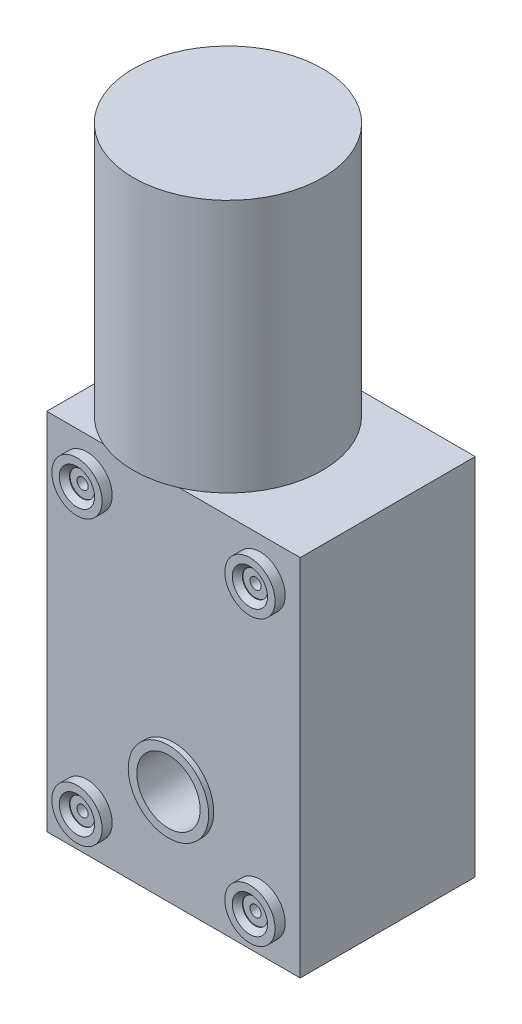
ISO-10303-21;
HEADER;
FILE_DESCRIPTION(('STEP AP214'),'2;1');
FILE_NAME('part.step','',(''),(''),'','','');
FILE_SCHEMA(('AUTOMOTIVE_DESIGN { 1 0 10303 214 1 1 1 1 }'));
ENDSEC;
DATA;
#1=APPLICATION_CONTEXT('core data for automotive mechanical design processes');
#2=APPLICATION_PROTOCOL_DEFINITION('international standard','automotive_design',2000,#1);
#3=PRODUCT_CONTEXT('',#1,'mechanical');
#4=PRODUCT('Part','Part','',(#3));
#5=PRODUCT_RELATED_PRODUCT_CATEGORY('part','',(#4));
#6=PRODUCT_DEFINITION_FORMATION('','',#4);
#7=PRODUCT_DEFINITION_CONTEXT('part definition',#1,'design');
#8=PRODUCT_DEFINITION('design','',#6,#7);
#9=PRODUCT_DEFINITION_SHAPE('','',#8);
#10=(LENGTH_UNIT() NAMED_UNIT(*) SI_UNIT(.MILLI.,.METRE.));
#11=(NAMED_UNIT(*) PLANE_ANGLE_UNIT() SI_UNIT($,.RADIAN.));
#12=(NAMED_UNIT(*) SI_UNIT($,.STERADIAN.) SOLID_ANGLE_UNIT());
#13=UNCERTAINTY_MEASURE_WITH_UNIT(LENGTH_MEASURE(1.E-05),#10,'distance_accuracy_value','');
#14=(GEOMETRIC_REPRESENTATION_CONTEXT(3) GLOBAL_UNCERTAINTY_ASSIGNED_CONTEXT((#13)) GLOBAL_UNIT_ASSIGNED_CONTEXT((#10,
#11,#12)) REPRESENTATION_CONTEXT('',''));
#15=CARTESIAN_POINT('',(0.,0.,0.));
#16=DIRECTION('',(0.,0.,1.));
#17=DIRECTION('',(1.,0.,0.));
#18=AXIS2_PLACEMENT_3D('',#15,#16,#17);
#19=CARTESIAN_POINT('',(0.,45.974,0.));
#20=DIRECTION('',(0.,-1.,0.));
#21=DIRECTION('',(0.,0.,-1.));
#22=AXIS2_PLACEMENT_3D('',#19,#20,#21);
#23=PLANE('',#22);
#24=CARTESIAN_POINT('',(11.938,45.974,-10.9404351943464));
#25=DIRECTION('',(0.,1.,0.));
#26=DIRECTION('',(0.,0.,1.));
#27=AXIS2_PLACEMENT_3D('',#24,#25,#26);
#28=CIRCLE('',#27,11.938);
#29=CARTESIAN_POINT('',(16.7153132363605,45.974,0.));
#30=VERTEX_POINT('',#29);
#31=CARTESIAN_POINT('',(16.1835378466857,45.974,-22.098));
#32=VERTEX_POINT('',#31);
#33=EDGE_CURVE('E219',#30,#32,#28,.T.);
#34=ORIENTED_EDGE('',*,*,#33,.F.);
#35=DIRECTION('',(1.,0.,0.));
#36=VECTOR('',#35,1.);
#37=CARTESIAN_POINT('',(0.,45.974,0.));
#38=LINE('',#37,#36);
#39=CARTESIAN_POINT('',(32.004,45.974,0.));
#40=VERTEX_POINT('',#39);
#41=EDGE_CURVE('E228',#30,#40,#38,.T.);
#42=ORIENTED_EDGE('',*,*,#41,.T.);
#43=DIRECTION('',(0.,0.,-1.));
#44=VECTOR('',#43,1.);
#45=CARTESIAN_POINT('',(32.004,45.974,0.));
#46=LINE('',#45,#44);
#47=CARTESIAN_POINT('',(32.004,45.974,-22.098));
#48=VERTEX_POINT('',#47);
#49=EDGE_CURVE('E233',#40,#48,#46,.T.);
#50=ORIENTED_EDGE('',*,*,#49,.T.);
#51=DIRECTION('',(-1.,0.,0.));
#52=VECTOR('',#51,1.);
#53=CARTESIAN_POINT('',(0.,45.974,-22.098));
#54=LINE('',#53,#52);
#55=EDGE_CURVE('E238',#48,#32,#54,.T.);
#56=ORIENTED_EDGE('',*,*,#55,.T.);
#57=EDGE_LOOP('',(#34,#42,#50,#56));
#58=FACE_BOUND('',#57,.T.);
#59=ADVANCED_FACE('F45',(#58),#23,.F.);
#60=CARTESIAN_POINT('',(7.69246215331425,45.974,-22.098));
#61=VERTEX_POINT('',#60);
#62=CARTESIAN_POINT('',(0.,45.974,-10.9404351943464));
#63=VERTEX_POINT('',#62);
#64=EDGE_CURVE('E61',#61,#63,#28,.T.);
#65=ORIENTED_EDGE('',*,*,#64,.F.);
#66=CARTESIAN_POINT('',(0.,45.974,-22.098));
#67=VERTEX_POINT('',#66);
#68=EDGE_CURVE('E237',#61,#67,#54,.T.);
#69=ORIENTED_EDGE('',*,*,#68,.T.);
#70=DIRECTION('',(0.,0.,1.));
#71=VECTOR('',#70,1.);
#72=CARTESIAN_POINT('',(0.,45.974,0.));
#73=LINE('',#72,#71);
#74=EDGE_CURVE('E225',#67,#63,#73,.T.);
#75=ORIENTED_EDGE('',*,*,#74,.T.);
#76=EDGE_LOOP('',(#65,#69,#75));
#77=FACE_BOUND('',#76,.T.);
#78=ADVANCED_FACE('F314',(#77),#23,.F.);
#79=CARTESIAN_POINT('',(0.,45.974,0.));
#80=DIRECTION('',(1.,0.,0.));
#81=DIRECTION('',(0.,0.,-1.));
#82=AXIS2_PLACEMENT_3D('',#79,#80,#81);
#83=PLANE('',#82);
#84=DIRECTION('',(0.,0.,1.));
#85=VECTOR('',#84,1.);
#86=CARTESIAN_POINT('',(0.,0.,0.));
#87=LINE('',#86,#85);
#88=CARTESIAN_POINT('',(0.,0.,-22.098));
#89=VERTEX_POINT('',#88);
#90=CARTESIAN_POINT('',(0.,0.,0.));
#91=VERTEX_POINT('',#90);
#92=EDGE_CURVE('E218',#89,#91,#87,.T.);
#93=ORIENTED_EDGE('',*,*,#92,.T.);
#94=DIRECTION('',(0.,-1.,0.));
#95=VECTOR('',#94,1.);
#96=CARTESIAN_POINT('',(0.,45.974,0.));
#97=LINE('',#96,#95);
#98=CARTESIAN_POINT('',(0.,45.974,0.));
#99=VERTEX_POINT('',#98);
#100=EDGE_CURVE('E265',#99,#91,#97,.T.);
#101=ORIENTED_EDGE('',*,*,#100,.F.);
#102=EDGE_CURVE('E229',#63,#99,#73,.T.);
#103=ORIENTED_EDGE('',*,*,#102,.F.);
#104=ORIENTED_EDGE('',*,*,#74,.F.);
#105=DIRECTION('',(0.,-1.,0.));
#106=VECTOR('',#105,1.);
#107=CARTESIAN_POINT('',(0.,45.974,-22.098));
#108=LINE('',#107,#106);
#109=EDGE_CURVE('E241',#67,#89,#108,.T.);
#110=ORIENTED_EDGE('',*,*,#109,.T.);
#111=EDGE_LOOP('',(#93,#101,#103,#104,#110));
#112=FACE_BOUND('',#111,.T.);
#113=ADVANCED_FACE('F47',(#112),#83,.F.);
#114=CARTESIAN_POINT('',(0.,45.974,0.));
#115=DIRECTION('',(0.,0.,-1.));
#116=DIRECTION('',(-1.,0.,0.));
#117=AXIS2_PLACEMENT_3D('',#114,#115,#116);
#118=PLANE('',#117);
#119=CARTESIAN_POINT('',(16.002,12.7,0.));
#120=DIRECTION('',(0.,0.,-1.));
#121=DIRECTION('',(-1.,0.,0.));
#122=AXIS2_PLACEMENT_3D('',#119,#120,#121);
#123=CIRCLE('',#122,5.08);
#124=CARTESIAN_POINT('',(10.922,12.7,0.));
#125=VERTEX_POINT('',#124);
#126=EDGE_CURVE('E11',#125,#125,#123,.F.);
#127=ORIENTED_EDGE('',*,*,#126,.F.);
#128=EDGE_LOOP('',(#127));
#129=FACE_BOUND('',#128,.T.);
#130=CARTESIAN_POINT('',(5.08,5.08,0.));
#131=DIRECTION('',(0.,0.,-1.));
#132=DIRECTION('',(-1.,0.,0.));
#133=AXIS2_PLACEMENT_3D('',#130,#131,#132);
#134=CIRCLE('',#133,3.175);
#135=CARTESIAN_POINT('',(1.905,5.08,0.));
#136=VERTEX_POINT('',#135);
#137=EDGE_CURVE('E54',#136,#136,#134,.F.);
#138=ORIENTED_EDGE('',*,*,#137,.F.);
#139=EDGE_LOOP('',(#138));
#140=FACE_BOUND('',#139,.T.);
#141=CARTESIAN_POINT('',(26.924,5.08,0.));
#142=DIRECTION('',(0.,0.,-1.));
#143=DIRECTION('',(-1.,0.,0.));
#144=AXIS2_PLACEMENT_3D('',#141,#142,#143);
#145=CIRCLE('',#144,3.175);
#146=CARTESIAN_POINT('',(23.749,5.08,0.));
#147=VERTEX_POINT('',#146);
#148=EDGE_CURVE('E277',#147,#147,#145,.F.);
#149=ORIENTED_EDGE('',*,*,#148,.F.);
#150=EDGE_LOOP('',(#149));
#151=FACE_BOUND('',#150,.T.);
#152=CARTESIAN_POINT('',(26.924,40.894,0.));
#153=DIRECTION('',(0.,0.,-1.));
#154=DIRECTION('',(-1.,0.,0.));
#155=AXIS2_PLACEMENT_3D('',#152,#153,#154);
#156=CIRCLE('',#155,3.175);
#157=CARTESIAN_POINT('',(23.749,40.894,0.));
#158=VERTEX_POINT('',#157);
#159=EDGE_CURVE('E273',#158,#158,#156,.F.);
#160=ORIENTED_EDGE('',*,*,#159,.F.);
#161=EDGE_LOOP('',(#160));
#162=FACE_BOUND('',#161,.T.);
#163=CARTESIAN_POINT('',(5.08,40.894,0.));
#164=DIRECTION('',(0.,0.,-1.));
#165=DIRECTION('',(-1.,0.,0.));
#166=AXIS2_PLACEMENT_3D('',#163,#164,#165);
#167=CIRCLE('',#166,3.175);
#168=CARTESIAN_POINT('',(1.905,40.894,0.));
#169=VERTEX_POINT('',#168);
#170=EDGE_CURVE('E269',#169,#169,#167,.F.);
#171=ORIENTED_EDGE('',*,*,#170,.F.);
#172=EDGE_LOOP('',(#171));
#173=FACE_BOUND('',#172,.T.);
#174=DIRECTION('',(1.,0.,0.));
#175=VECTOR('',#174,1.);
#176=CARTESIAN_POINT('',(0.,0.,0.));
#177=LINE('',#176,#175);
#178=CARTESIAN_POINT('',(32.004,0.,0.));
#179=VERTEX_POINT('',#178);
#180=EDGE_CURVE('E245',#91,#179,#177,.T.);
#181=ORIENTED_EDGE('',*,*,#180,.T.);
#182=DIRECTION('',(0.,-1.,0.));
#183=VECTOR('',#182,1.);
#184=CARTESIAN_POINT('',(32.004,45.974,0.));
#185=LINE('',#184,#183);
#186=EDGE_CURVE('E261',#40,#179,#185,.T.);
#187=ORIENTED_EDGE('',*,*,#186,.F.);
#188=ORIENTED_EDGE('',*,*,#41,.F.);
#189=CARTESIAN_POINT('',(7.16068676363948,45.974,0.));
#190=VERTEX_POINT('',#189);
#191=EDGE_CURVE('E234',#190,#30,#38,.T.);
#192=ORIENTED_EDGE('',*,*,#191,.F.);
#193=EDGE_CURVE('E230',#99,#190,#38,.T.);
#194=ORIENTED_EDGE('',*,*,#193,.F.);
#195=ORIENTED_EDGE('',*,*,#100,.T.);
#196=EDGE_LOOP('',(#181,#187,#188,#192,#194,#195));
#197=FACE_BOUND('',#196,.T.);
#198=ADVANCED_FACE('F286',(#129,#140,#151,#162,#173,#197),#118,.F.);
#199=CARTESIAN_POINT('',(32.004,45.974,0.));
#200=DIRECTION('',(-1.,0.,0.));
#201=DIRECTION('',(0.,0.,1.));
#202=AXIS2_PLACEMENT_3D('',#199,#200,#201);
#203=PLANE('',#202);
#204=DIRECTION('',(0.,0.,-1.));
#205=VECTOR('',#204,1.);
#206=CARTESIAN_POINT('',(32.004,0.,0.));
#207=LINE('',#206,#205);
#208=CARTESIAN_POINT('',(32.004,0.,-22.098));
#209=VERTEX_POINT('',#208);
#210=EDGE_CURVE('E248',#179,#209,#207,.T.);
#211=ORIENTED_EDGE('',*,*,#210,.T.);
#212=DIRECTION('',(0.,-1.,0.));
#213=VECTOR('',#212,1.);
#214=CARTESIAN_POINT('',(32.004,45.974,-22.098));
#215=LINE('',#214,#213);
#216=EDGE_CURVE('E257',#48,#209,#215,.T.);
#217=ORIENTED_EDGE('',*,*,#216,.F.);
#218=ORIENTED_EDGE('',*,*,#49,.F.);
#219=ORIENTED_EDGE('',*,*,#186,.T.);
#220=EDGE_LOOP('',(#211,#217,#218,#219));
#221=FACE_BOUND('',#220,.T.);
#222=ADVANCED_FACE('F289',(#221),#203,.F.);
#223=CARTESIAN_POINT('',(0.,45.974,-22.098));
#224=DIRECTION('',(0.,0.,1.));
#225=DIRECTION('',(1.,0.,0.));
#226=AXIS2_PLACEMENT_3D('',#223,#224,#225);
#227=PLANE('',#226);
#228=DIRECTION('',(-1.,0.,0.));
#229=VECTOR('',#228,1.);
#230=CARTESIAN_POINT('',(0.,0.,-22.098));
#231=LINE('',#230,#229);
#232=EDGE_CURVE('E251',#209,#89,#231,.T.);
#233=ORIENTED_EDGE('',*,*,#232,.T.);
#234=ORIENTED_EDGE('',*,*,#109,.F.);
#235=ORIENTED_EDGE('',*,*,#68,.F.);
#236=EDGE_CURVE('E68',#32,#61,#54,.T.);
#237=ORIENTED_EDGE('',*,*,#236,.F.);
#238=ORIENTED_EDGE('',*,*,#55,.F.);
#239=ORIENTED_EDGE('',*,*,#216,.T.);
#240=EDGE_LOOP('',(#233,#234,#235,#237,#238,#239));
#241=FACE_BOUND('',#240,.T.);
#242=ADVANCED_FACE('F310',(#241),#227,.F.);
#243=EDGE_CURVE('E224',#63,#190,#28,.T.);
#244=ORIENTED_EDGE('',*,*,#243,.F.);
#245=ORIENTED_EDGE('',*,*,#102,.T.);
#246=ORIENTED_EDGE('',*,*,#193,.T.);
#247=EDGE_LOOP('',(#244,#245,#246));
#248=FACE_BOUND('',#247,.T.);
#249=ADVANCED_FACE('F349',(#248),#23,.F.);
#250=CARTESIAN_POINT('',(0.,0.,0.));
#251=DIRECTION('',(0.,-1.,0.));
#252=DIRECTION('',(0.,0.,-1.));
#253=AXIS2_PLACEMENT_3D('',#250,#251,#252);
#254=PLANE('',#253);
#255=ORIENTED_EDGE('',*,*,#92,.F.);
#256=ORIENTED_EDGE('',*,*,#232,.F.);
#257=ORIENTED_EDGE('',*,*,#210,.F.);
#258=ORIENTED_EDGE('',*,*,#180,.F.);
#259=EDGE_LOOP('',(#255,#256,#257,#258));
#260=FACE_BOUND('',#259,.T.);
#261=ADVANCED_FACE('F308',(#260),#254,.T.);
#262=CARTESIAN_POINT('',(11.938,45.974,-10.9404351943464));
#263=DIRECTION('',(0.,1.,0.));
#264=DIRECTION('',(0.,0.,1.));
#265=AXIS2_PLACEMENT_3D('',#262,#263,#264);
#266=PLANE('',#265);
#267=EDGE_CURVE('E213',#190,#30,#28,.T.);
#268=ORIENTED_EDGE('',*,*,#267,.F.);
#269=ORIENTED_EDGE('',*,*,#191,.T.);
#270=EDGE_LOOP('',(#268,#269));
#271=FACE_BOUND('',#270,.T.);
#272=ADVANCED_FACE('F328',(#271),#266,.F.);
#273=EDGE_CURVE('E223',#32,#61,#28,.T.);
#274=ORIENTED_EDGE('',*,*,#273,.F.);
#275=ORIENTED_EDGE('',*,*,#236,.T.);
#276=EDGE_LOOP('',(#274,#275));
#277=FACE_BOUND('',#276,.T.);
#278=ADVANCED_FACE('F334',(#277),#266,.F.);
#279=CARTESIAN_POINT('',(11.938,77.978,-10.9404351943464));
#280=DIRECTION('',(0.,-1.,0.));
#281=DIRECTION('',(0.,0.,-1.));
#282=AXIS2_PLACEMENT_3D('',#279,#280,#281);
#283=CYLINDRICAL_SURFACE('',#282,11.938);
#284=CARTESIAN_POINT('',(11.938,77.978,-10.9404351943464));
#285=DIRECTION('',(0.,1.,0.));
#286=DIRECTION('',(0.,0.,1.));
#287=AXIS2_PLACEMENT_3D('',#284,#285,#286);
#288=CIRCLE('',#287,11.938);
#289=CARTESIAN_POINT('',(11.938,77.978,0.997564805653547));
#290=VERTEX_POINT('',#289);
#291=EDGE_CURVE('E214',#290,#290,#288,.T.);
#292=ORIENTED_EDGE('',*,*,#291,.F.);
#293=EDGE_LOOP('',(#292));
#294=FACE_BOUND('',#293,.T.);
#295=ORIENTED_EDGE('',*,*,#33,.T.);
#296=ORIENTED_EDGE('',*,*,#273,.T.);
#297=ORIENTED_EDGE('',*,*,#64,.T.);
#298=ORIENTED_EDGE('',*,*,#243,.T.);
#299=ORIENTED_EDGE('',*,*,#267,.T.);
#300=EDGE_LOOP('',(#295,#296,#297,#298,#299));
#301=FACE_BOUND('',#300,.T.);
#302=ADVANCED_FACE('F318',(#294,#301),#283,.T.);
#303=CARTESIAN_POINT('',(11.938,77.978,-10.9404351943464));
#304=DIRECTION('',(0.,1.,0.));
#305=DIRECTION('',(0.,0.,1.));
#306=AXIS2_PLACEMENT_3D('',#303,#304,#305);
#307=PLANE('',#306);
#308=ORIENTED_EDGE('',*,*,#291,.T.);
#309=EDGE_LOOP('',(#308));
#310=FACE_BOUND('',#309,.T.);
#311=ADVANCED_FACE('F343',(#310),#307,.T.);
#312=CARTESIAN_POINT('',(5.08,40.894,1.27));
#313=DIRECTION('',(0.,0.,-1.));
#314=DIRECTION('',(-1.,0.,0.));
#315=AXIS2_PLACEMENT_3D('',#312,#313,#314);
#316=CYLINDRICAL_SURFACE('',#315,3.175);
#317=CARTESIAN_POINT('',(5.08,40.894,1.27));
#318=DIRECTION('',(0.,0.,1.));
#319=DIRECTION('',(1.,0.,0.));
#320=AXIS2_PLACEMENT_3D('',#317,#318,#319);
#321=CIRCLE('',#320,3.175);
#322=CARTESIAN_POINT('',(8.255,40.894,1.27));
#323=VERTEX_POINT('',#322);
#324=EDGE_CURVE('E202',#323,#323,#321,.T.);
#325=ORIENTED_EDGE('',*,*,#324,.F.);
#326=EDGE_LOOP('',(#325));
#327=FACE_BOUND('',#326,.T.);
#328=ORIENTED_EDGE('',*,*,#170,.T.);
#329=EDGE_LOOP('',(#328));
#330=FACE_BOUND('',#329,.T.);
#331=ADVANCED_FACE('F413',(#327,#330),#316,.T.);
#332=CARTESIAN_POINT('',(5.08,40.894,1.27));
#333=DIRECTION('',(0.,0.,1.));
#334=DIRECTION('',(1.,0.,0.));
#335=AXIS2_PLACEMENT_3D('',#332,#333,#334);
#336=PLANE('',#335);
#337=CARTESIAN_POINT('',(5.08,40.894,1.27));
#338=DIRECTION('',(0.,0.,1.));
#339=DIRECTION('',(1.,0.,0.));
#340=AXIS2_PLACEMENT_3D('',#337,#338,#339);
#341=CIRCLE('',#340,2.2225);
#342=CARTESIAN_POINT('',(7.3025,40.894,1.27));
#343=VERTEX_POINT('',#342);
#344=EDGE_CURVE('E731',#343,#343,#341,.T.);
#345=ORIENTED_EDGE('',*,*,#344,.F.);
#346=EDGE_LOOP('',(#345));
#347=FACE_BOUND('',#346,.T.);
#348=ORIENTED_EDGE('',*,*,#324,.T.);
#349=EDGE_LOOP('',(#348));
#350=FACE_BOUND('',#349,.T.);
#351=ADVANCED_FACE('F422',(#347,#350),#336,.T.);
#352=CARTESIAN_POINT('',(26.924,40.894,1.27));
#353=DIRECTION('',(0.,0.,-1.));
#354=DIRECTION('',(-1.,0.,0.));
#355=AXIS2_PLACEMENT_3D('',#352,#353,#354);
#356=CYLINDRICAL_SURFACE('',#355,3.175);
#357=CARTESIAN_POINT('',(26.924,40.894,1.27));
#358=DIRECTION('',(0.,0.,1.));
#359=DIRECTION('',(1.,0.,0.));
#360=AXIS2_PLACEMENT_3D('',#357,#358,#359);
#361=CIRCLE('',#360,3.175);
#362=CARTESIAN_POINT('',(30.099,40.894,1.27));
#363=VERTEX_POINT('',#362);
#364=EDGE_CURVE('E198',#363,#363,#361,.T.);
#365=ORIENTED_EDGE('',*,*,#364,.F.);
#366=EDGE_LOOP('',(#365));
#367=FACE_BOUND('',#366,.T.);
#368=ORIENTED_EDGE('',*,*,#159,.T.);
#369=EDGE_LOOP('',(#368));
#370=FACE_BOUND('',#369,.T.);
#371=ADVANCED_FACE('F433',(#367,#370),#356,.T.);
#372=CARTESIAN_POINT('',(26.924,40.894,1.27));
#373=DIRECTION('',(0.,0.,1.));
#374=DIRECTION('',(1.,0.,0.));
#375=AXIS2_PLACEMENT_3D('',#372,#373,#374);
#376=PLANE('',#375);
#377=CARTESIAN_POINT('',(26.924,40.894,1.27));
#378=DIRECTION('',(0.,0.,1.));
#379=DIRECTION('',(1.,0.,0.));
#380=AXIS2_PLACEMENT_3D('',#377,#378,#379);
#381=CIRCLE('',#380,2.2225);
#382=CARTESIAN_POINT('',(29.1465,40.894,1.27));
#383=VERTEX_POINT('',#382);
#384=EDGE_CURVE('E125',#383,#383,#381,.T.);
#385=ORIENTED_EDGE('',*,*,#384,.F.);
#386=EDGE_LOOP('',(#385));
#387=FACE_BOUND('',#386,.T.);
#388=ORIENTED_EDGE('',*,*,#364,.T.);
#389=EDGE_LOOP('',(#388));
#390=FACE_BOUND('',#389,.T.);
#391=ADVANCED_FACE('F444',(#387,#390),#376,.T.);
#392=CARTESIAN_POINT('',(26.924,5.08,1.27));
#393=DIRECTION('',(0.,0.,-1.));
#394=DIRECTION('',(-1.,0.,0.));
#395=AXIS2_PLACEMENT_3D('',#392,#393,#394);
#396=CYLINDRICAL_SURFACE('',#395,3.175);
#397=CARTESIAN_POINT('',(26.924,5.08,1.27));
#398=DIRECTION('',(0.,0.,1.));
#399=DIRECTION('',(1.,0.,0.));
#400=AXIS2_PLACEMENT_3D('',#397,#398,#399);
#401=CIRCLE('',#400,3.175);
#402=CARTESIAN_POINT('',(30.099,5.08,1.27));
#403=VERTEX_POINT('',#402);
#404=EDGE_CURVE('E203',#403,#403,#401,.T.);
#405=ORIENTED_EDGE('',*,*,#404,.F.);
#406=EDGE_LOOP('',(#405));
#407=FACE_BOUND('',#406,.T.);
#408=ORIENTED_EDGE('',*,*,#148,.T.);
#409=EDGE_LOOP('',(#408));
#410=FACE_BOUND('',#409,.T.);
#411=ADVANCED_FACE('F454',(#407,#410),#396,.T.);
#412=CARTESIAN_POINT('',(26.924,5.08,1.27));
#413=DIRECTION('',(0.,0.,1.));
#414=DIRECTION('',(1.,0.,0.));
#415=AXIS2_PLACEMENT_3D('',#412,#413,#414);
#416=PLANE('',#415);
#417=CARTESIAN_POINT('',(26.924,5.08,1.27));
#418=DIRECTION('',(0.,0.,1.));
#419=DIRECTION('',(1.,0.,0.));
#420=AXIS2_PLACEMENT_3D('',#417,#418,#419);
#421=CIRCLE('',#420,2.2225);
#422=CARTESIAN_POINT('',(29.1465,5.08,1.27));
#423=VERTEX_POINT('',#422);
#424=EDGE_CURVE('E153',#423,#423,#421,.T.);
#425=ORIENTED_EDGE('',*,*,#424,.F.);
#426=EDGE_LOOP('',(#425));
#427=FACE_BOUND('',#426,.T.);
#428=ORIENTED_EDGE('',*,*,#404,.T.);
#429=EDGE_LOOP('',(#428));
#430=FACE_BOUND('',#429,.T.);
#431=ADVANCED_FACE('F464',(#427,#430),#416,.T.);
#432=CARTESIAN_POINT('',(5.08,5.08,1.27));
#433=DIRECTION('',(0.,0.,-1.));
#434=DIRECTION('',(-1.,0.,0.));
#435=AXIS2_PLACEMENT_3D('',#432,#433,#434);
#436=CYLINDRICAL_SURFACE('',#435,3.175);
#437=CARTESIAN_POINT('',(5.08,5.08,1.27));
#438=DIRECTION('',(0.,0.,1.));
#439=DIRECTION('',(1.,0.,0.));
#440=AXIS2_PLACEMENT_3D('',#437,#438,#439);
#441=CIRCLE('',#440,3.175);
#442=CARTESIAN_POINT('',(8.255,5.08,1.27));
#443=VERTEX_POINT('',#442);
#444=EDGE_CURVE('E197',#443,#443,#441,.T.);
#445=ORIENTED_EDGE('',*,*,#444,.F.);
#446=EDGE_LOOP('',(#445));
#447=FACE_BOUND('',#446,.T.);
#448=ORIENTED_EDGE('',*,*,#137,.T.);
#449=EDGE_LOOP('',(#448));
#450=FACE_BOUND('',#449,.T.);
#451=ADVANCED_FACE('F284',(#447,#450),#436,.T.);
#452=CARTESIAN_POINT('',(5.08,5.08,1.27));
#453=DIRECTION('',(0.,0.,1.));
#454=DIRECTION('',(1.,0.,0.));
#455=AXIS2_PLACEMENT_3D('',#452,#453,#454);
#456=PLANE('',#455);
#457=CARTESIAN_POINT('',(5.08,5.08,1.27));
#458=DIRECTION('',(0.,0.,1.));
#459=DIRECTION('',(1.,0.,0.));
#460=AXIS2_PLACEMENT_3D('',#457,#458,#459);
#461=CIRCLE('',#460,2.2225);
#462=CARTESIAN_POINT('',(7.3025,5.08,1.27));
#463=VERTEX_POINT('',#462);
#464=EDGE_CURVE('E173',#463,#463,#461,.T.);
#465=ORIENTED_EDGE('',*,*,#464,.F.);
#466=EDGE_LOOP('',(#465));
#467=FACE_BOUND('',#466,.T.);
#468=ORIENTED_EDGE('',*,*,#444,.T.);
#469=EDGE_LOOP('',(#468));
#470=FACE_BOUND('',#469,.T.);
#471=ADVANCED_FACE('F483',(#467,#470),#456,.T.);
#472=CARTESIAN_POINT('',(16.002,12.7,0.635));
#473=DIRECTION('',(0.,0.,-1.));
#474=DIRECTION('',(-1.,0.,0.));
#475=AXIS2_PLACEMENT_3D('',#472,#473,#474);
#476=CYLINDRICAL_SURFACE('',#475,5.08);
#477=CARTESIAN_POINT('',(16.002,12.7,0.635));
#478=DIRECTION('',(0.,0.,1.));
#479=DIRECTION('',(1.,0.,0.));
#480=AXIS2_PLACEMENT_3D('',#477,#478,#479);
#481=CIRCLE('',#480,5.08);
#482=CARTESIAN_POINT('',(21.082,12.7,0.635));
#483=VERTEX_POINT('',#482);
#484=EDGE_CURVE('E193',#483,#483,#481,.T.);
#485=ORIENTED_EDGE('',*,*,#484,.F.);
#486=EDGE_LOOP('',(#485));
#487=FACE_BOUND('',#486,.T.);
#488=ORIENTED_EDGE('',*,*,#126,.T.);
#489=EDGE_LOOP('',(#488));
#490=FACE_BOUND('',#489,.T.);
#491=ADVANCED_FACE('F492',(#487,#490),#476,.T.);
#492=CARTESIAN_POINT('',(16.002,12.7,0.635));
#493=DIRECTION('',(0.,0.,1.));
#494=DIRECTION('',(1.,0.,0.));
#495=AXIS2_PLACEMENT_3D('',#492,#493,#494);
#496=PLANE('',#495);
#497=CARTESIAN_POINT('',(16.002,12.7,0.635));
#498=DIRECTION('',(0.,0.,1.));
#499=DIRECTION('',(1.,0.,0.));
#500=AXIS2_PLACEMENT_3D('',#497,#498,#499);
#501=CIRCLE('',#500,4.0005);
#502=CARTESIAN_POINT('',(20.0025,12.7,0.635));
#503=VERTEX_POINT('',#502);
#504=EDGE_CURVE('E732',#503,#503,#501,.T.);
#505=ORIENTED_EDGE('',*,*,#504,.F.);
#506=EDGE_LOOP('',(#505));
#507=FACE_BOUND('',#506,.T.);
#508=ORIENTED_EDGE('',*,*,#484,.T.);
#509=EDGE_LOOP('',(#508));
#510=FACE_BOUND('',#509,.T.);
#511=ADVANCED_FACE('F502',(#507,#510),#496,.T.);
#512=CARTESIAN_POINT('',(5.08,5.08,-11.43));
#513=DIRECTION('',(0.,0.,1.));
#514=DIRECTION('',(1.,0.,0.));
#515=AXIS2_PLACEMENT_3D('',#512,#513,#514);
#516=CONICAL_SURFACE('',#515,0.698499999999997,1.02974425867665);
#517=CARTESIAN_POINT('',(5.08,5.08,-11.8497011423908));
#518=VERTEX_POINT('',#517);
#519=VERTEX_LOOP('',#518);
#520=FACE_BOUND('',#519,.T.);
#521=CARTESIAN_POINT('',(5.08,5.08,-11.43));
#522=DIRECTION('',(0.,0.,1.));
#523=DIRECTION('',(1.,0.,0.));
#524=AXIS2_PLACEMENT_3D('',#521,#522,#523);
#525=CIRCLE('',#524,0.698499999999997);
#526=CARTESIAN_POINT('',(5.7785,5.08,-11.43));
#527=VERTEX_POINT('',#526);
#528=EDGE_CURVE('E189',#527,#527,#525,.T.);
#529=ORIENTED_EDGE('',*,*,#528,.T.);
#530=EDGE_LOOP('',(#529));
#531=FACE_BOUND('',#530,.T.);
#532=ADVANCED_FACE('F512',(#520,#531),#516,.F.);
#533=CARTESIAN_POINT('',(5.08,5.08,1.27));
#534=DIRECTION('',(0.,0.,1.));
#535=DIRECTION('',(1.,0.,0.));
#536=AXIS2_PLACEMENT_3D('',#533,#534,#535);
#537=CYLINDRICAL_SURFACE('',#536,0.698499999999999);
#538=ORIENTED_EDGE('',*,*,#528,.F.);
#539=EDGE_LOOP('',(#538));
#540=FACE_BOUND('',#539,.T.);
#541=CARTESIAN_POINT('',(5.08,5.08,0.5588));
#542=DIRECTION('',(0.,0.,1.));
#543=DIRECTION('',(1.,0.,0.));
#544=AXIS2_PLACEMENT_3D('',#541,#542,#543);
#545=CIRCLE('',#544,0.698500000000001);
#546=CARTESIAN_POINT('',(5.7785,5.08,0.5588));
#547=VERTEX_POINT('',#546);
#548=EDGE_CURVE('E185',#547,#547,#545,.T.);
#549=ORIENTED_EDGE('',*,*,#548,.T.);
#550=EDGE_LOOP('',(#549));
#551=FACE_BOUND('',#550,.T.);
#552=ADVANCED_FACE('F523',(#540,#551),#537,.F.);
#553=CARTESIAN_POINT('',(5.7785,5.08,0.5588));
#554=DIRECTION('',(0.,0.,-1.));
#555=DIRECTION('',(-1.,0.,0.));
#556=AXIS2_PLACEMENT_3D('',#553,#554,#555);
#557=PLANE('',#556);
#558=ORIENTED_EDGE('',*,*,#548,.F.);
#559=EDGE_LOOP('',(#558));
#560=FACE_BOUND('',#559,.T.);
#561=CARTESIAN_POINT('',(5.08,5.08,0.5588));
#562=DIRECTION('',(0.,0.,1.));
#563=DIRECTION('',(1.,0.,0.));
#564=AXIS2_PLACEMENT_3D('',#561,#562,#563);
#565=CIRCLE('',#564,1.5875);
#566=CARTESIAN_POINT('',(6.6675,5.08,0.5588));
#567=VERTEX_POINT('',#566);
#568=EDGE_CURVE('E181',#567,#567,#565,.T.);
#569=ORIENTED_EDGE('',*,*,#568,.T.);
#570=EDGE_LOOP('',(#569));
#571=FACE_BOUND('',#570,.T.);
#572=ADVANCED_FACE('F533',(#560,#571),#557,.F.);
#573=CARTESIAN_POINT('',(5.08,5.08,1.27));
#574=DIRECTION('',(0.,0.,1.));
#575=DIRECTION('',(1.,0.,0.));
#576=AXIS2_PLACEMENT_3D('',#573,#574,#575);
#577=CYLINDRICAL_SURFACE('',#576,1.5875);
#578=ORIENTED_EDGE('',*,*,#568,.F.);
#579=EDGE_LOOP('',(#578));
#580=FACE_BOUND('',#579,.T.);
#581=CARTESIAN_POINT('',(5.08,5.08,0.635));
#582=DIRECTION('',(0.,0.,1.));
#583=DIRECTION('',(1.,0.,0.));
#584=AXIS2_PLACEMENT_3D('',#581,#582,#583);
#585=CIRCLE('',#584,1.5875);
#586=CARTESIAN_POINT('',(6.6675,5.08,0.635));
#587=VERTEX_POINT('',#586);
#588=EDGE_CURVE('E177',#587,#587,#585,.T.);
#589=ORIENTED_EDGE('',*,*,#588,.T.);
#590=EDGE_LOOP('',(#589));
#591=FACE_BOUND('',#590,.T.);
#592=ADVANCED_FACE('F543',(#580,#591),#577,.F.);
#593=CARTESIAN_POINT('',(5.08,5.08,1.27));
#594=DIRECTION('',(0.,0.,1.));
#595=DIRECTION('',(1.,0.,0.));
#596=AXIS2_PLACEMENT_3D('',#593,#594,#595);
#597=CONICAL_SURFACE('',#596,2.2225,0.785398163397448);
#598=ORIENTED_EDGE('',*,*,#588,.F.);
#599=EDGE_LOOP('',(#598));
#600=FACE_BOUND('',#599,.T.);
#601=ORIENTED_EDGE('',*,*,#464,.T.);
#602=EDGE_LOOP('',(#601));
#603=FACE_BOUND('',#602,.T.);
#604=ADVANCED_FACE('F553',(#600,#603),#597,.F.);
#605=CARTESIAN_POINT('',(26.924,5.08,-11.43));
#606=DIRECTION('',(0.,0.,1.));
#607=DIRECTION('',(1.,0.,0.));
#608=AXIS2_PLACEMENT_3D('',#605,#606,#607);
#609=CONICAL_SURFACE('',#608,0.698499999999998,1.02974425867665);
#610=CARTESIAN_POINT('',(26.924,5.08,-11.8497011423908));
#611=VERTEX_POINT('',#610);
#612=VERTEX_LOOP('',#611);
#613=FACE_BOUND('',#612,.T.);
#614=CARTESIAN_POINT('',(26.924,5.08,-11.43));
#615=DIRECTION('',(0.,0.,1.));
#616=DIRECTION('',(1.,0.,0.));
#617=AXIS2_PLACEMENT_3D('',#614,#615,#616);
#618=CIRCLE('',#617,0.698499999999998);
#619=CARTESIAN_POINT('',(27.6225,5.08,-11.43));
#620=VERTEX_POINT('',#619);
#621=EDGE_CURVE('E169',#620,#620,#618,.T.);
#622=ORIENTED_EDGE('',*,*,#621,.T.);
#623=EDGE_LOOP('',(#622));
#624=FACE_BOUND('',#623,.T.);
#625=ADVANCED_FACE('F563',(#613,#624),#609,.F.);
#626=CARTESIAN_POINT('',(26.924,5.08,1.27));
#627=DIRECTION('',(0.,0.,1.));
#628=DIRECTION('',(1.,0.,0.));
#629=AXIS2_PLACEMENT_3D('',#626,#627,#628);
#630=CYLINDRICAL_SURFACE('',#629,0.698499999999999);
#631=ORIENTED_EDGE('',*,*,#621,.F.);
#632=EDGE_LOOP('',(#631));
#633=FACE_BOUND('',#632,.T.);
#634=CARTESIAN_POINT('',(26.924,5.08,0.5588));
#635=DIRECTION('',(0.,0.,1.));
#636=DIRECTION('',(1.,0.,0.));
#637=AXIS2_PLACEMENT_3D('',#634,#635,#636);
#638=CIRCLE('',#637,0.698500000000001);
#639=CARTESIAN_POINT('',(27.6225,5.08,0.5588));
#640=VERTEX_POINT('',#639);
#641=EDGE_CURVE('E165',#640,#640,#638,.T.);
#642=ORIENTED_EDGE('',*,*,#641,.T.);
#643=EDGE_LOOP('',(#642));
#644=FACE_BOUND('',#643,.T.);
#645=ADVANCED_FACE('F573',(#633,#644),#630,.F.);
#646=CARTESIAN_POINT('',(27.6225,5.08,0.5588));
#647=DIRECTION('',(0.,0.,-1.));
#648=DIRECTION('',(-1.,0.,0.));
#649=AXIS2_PLACEMENT_3D('',#646,#647,#648);
#650=PLANE('',#649);
#651=ORIENTED_EDGE('',*,*,#641,.F.);
#652=EDGE_LOOP('',(#651));
#653=FACE_BOUND('',#652,.T.);
#654=CARTESIAN_POINT('',(26.924,5.08,0.5588));
#655=DIRECTION('',(0.,0.,1.));
#656=DIRECTION('',(1.,0.,0.));
#657=AXIS2_PLACEMENT_3D('',#654,#655,#656);
#658=CIRCLE('',#657,1.5875);
#659=CARTESIAN_POINT('',(28.5115,5.08,0.5588));
#660=VERTEX_POINT('',#659);
#661=EDGE_CURVE('E161',#660,#660,#658,.T.);
#662=ORIENTED_EDGE('',*,*,#661,.T.);
#663=EDGE_LOOP('',(#662));
#664=FACE_BOUND('',#663,.T.);
#665=ADVANCED_FACE('F583',(#653,#664),#650,.F.);
#666=CARTESIAN_POINT('',(26.924,5.08,1.27));
#667=DIRECTION('',(0.,0.,1.));
#668=DIRECTION('',(1.,0.,0.));
#669=AXIS2_PLACEMENT_3D('',#666,#667,#668);
#670=CYLINDRICAL_SURFACE('',#669,1.5875);
#671=ORIENTED_EDGE('',*,*,#661,.F.);
#672=EDGE_LOOP('',(#671));
#673=FACE_BOUND('',#672,.T.);
#674=CARTESIAN_POINT('',(26.924,5.08,0.635));
#675=DIRECTION('',(0.,0.,1.));
#676=DIRECTION('',(1.,0.,0.));
#677=AXIS2_PLACEMENT_3D('',#674,#675,#676);
#678=CIRCLE('',#677,1.5875);
#679=CARTESIAN_POINT('',(28.5115,5.08,0.635));
#680=VERTEX_POINT('',#679);
#681=EDGE_CURVE('E157',#680,#680,#678,.T.);
#682=ORIENTED_EDGE('',*,*,#681,.T.);
#683=EDGE_LOOP('',(#682));
#684=FACE_BOUND('',#683,.T.);
#685=ADVANCED_FACE('F593',(#673,#684),#670,.F.);
#686=CARTESIAN_POINT('',(26.924,5.08,1.27));
#687=DIRECTION('',(0.,0.,1.));
#688=DIRECTION('',(1.,0.,0.));
#689=AXIS2_PLACEMENT_3D('',#686,#687,#688);
#690=CONICAL_SURFACE('',#689,2.2225,0.785398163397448);
#691=ORIENTED_EDGE('',*,*,#681,.F.);
#692=EDGE_LOOP('',(#691));
#693=FACE_BOUND('',#692,.T.);
#694=ORIENTED_EDGE('',*,*,#424,.T.);
#695=EDGE_LOOP('',(#694));
#696=FACE_BOUND('',#695,.T.);
#697=ADVANCED_FACE('F603',(#693,#696),#690,.F.);
#698=CARTESIAN_POINT('',(26.924,40.894,-11.43));
#699=DIRECTION('',(0.,0.,1.));
#700=DIRECTION('',(1.,0.,0.));
#701=AXIS2_PLACEMENT_3D('',#698,#699,#700);
#702=CONICAL_SURFACE('',#701,0.698499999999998,1.02974425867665);
#703=CARTESIAN_POINT('',(26.924,40.894,-11.8497011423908));
#704=VERTEX_POINT('',#703);
#705=VERTEX_LOOP('',#704);
#706=FACE_BOUND('',#705,.T.);
#707=CARTESIAN_POINT('',(26.924,40.894,-11.43));
#708=DIRECTION('',(0.,0.,1.));
#709=DIRECTION('',(1.,0.,0.));
#710=AXIS2_PLACEMENT_3D('',#707,#708,#709);
#711=CIRCLE('',#710,0.698499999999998);
#712=CARTESIAN_POINT('',(27.6225,40.894,-11.43));
#713=VERTEX_POINT('',#712);
#714=EDGE_CURVE('E149',#713,#713,#711,.T.);
#715=ORIENTED_EDGE('',*,*,#714,.T.);
#716=EDGE_LOOP('',(#715));
#717=FACE_BOUND('',#716,.T.);
#718=ADVANCED_FACE('F613',(#706,#717),#702,.F.);
#719=CARTESIAN_POINT('',(26.924,40.894,1.27));
#720=DIRECTION('',(0.,0.,1.));
#721=DIRECTION('',(1.,0.,0.));
#722=AXIS2_PLACEMENT_3D('',#719,#720,#721);
#723=CYLINDRICAL_SURFACE('',#722,0.698499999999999);
#724=ORIENTED_EDGE('',*,*,#714,.F.);
#725=EDGE_LOOP('',(#724));
#726=FACE_BOUND('',#725,.T.);
#727=CARTESIAN_POINT('',(26.924,40.894,0.5588));
#728=DIRECTION('',(0.,0.,1.));
#729=DIRECTION('',(1.,0.,0.));
#730=AXIS2_PLACEMENT_3D('',#727,#728,#729);
#731=CIRCLE('',#730,0.698500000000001);
#732=CARTESIAN_POINT('',(27.6225,40.894,0.5588));
#733=VERTEX_POINT('',#732);
#734=EDGE_CURVE('E145',#733,#733,#731,.T.);
#735=ORIENTED_EDGE('',*,*,#734,.T.);
#736=EDGE_LOOP('',(#735));
#737=FACE_BOUND('',#736,.T.);
#738=ADVANCED_FACE('F623',(#726,#737),#723,.F.);
#739=CARTESIAN_POINT('',(27.6225,40.894,0.5588));
#740=DIRECTION('',(0.,0.,-1.));
#741=DIRECTION('',(-1.,0.,0.));
#742=AXIS2_PLACEMENT_3D('',#739,#740,#741);
#743=PLANE('',#742);
#744=ORIENTED_EDGE('',*,*,#734,.F.);
#745=EDGE_LOOP('',(#744));
#746=FACE_BOUND('',#745,.T.);
#747=CARTESIAN_POINT('',(26.924,40.894,0.5588));
#748=DIRECTION('',(0.,0.,1.));
#749=DIRECTION('',(1.,0.,0.));
#750=AXIS2_PLACEMENT_3D('',#747,#748,#749);
#751=CIRCLE('',#750,1.5875);
#752=CARTESIAN_POINT('',(28.5115,40.894,0.5588));
#753=VERTEX_POINT('',#752);
#754=EDGE_CURVE('E141',#753,#753,#751,.T.);
#755=ORIENTED_EDGE('',*,*,#754,.T.);
#756=EDGE_LOOP('',(#755));
#757=FACE_BOUND('',#756,.T.);
#758=ADVANCED_FACE('F633',(#746,#757),#743,.F.);
#759=CARTESIAN_POINT('',(26.924,40.894,1.27));
#760=DIRECTION('',(0.,0.,1.));
#761=DIRECTION('',(1.,0.,0.));
#762=AXIS2_PLACEMENT_3D('',#759,#760,#761);
#763=CYLINDRICAL_SURFACE('',#762,1.5875);
#764=ORIENTED_EDGE('',*,*,#754,.F.);
#765=EDGE_LOOP('',(#764));
#766=FACE_BOUND('',#765,.T.);
#767=CARTESIAN_POINT('',(26.924,40.894,0.635));
#768=DIRECTION('',(0.,0.,1.));
#769=DIRECTION('',(1.,0.,0.));
#770=AXIS2_PLACEMENT_3D('',#767,#768,#769);
#771=CIRCLE('',#770,1.5875);
#772=CARTESIAN_POINT('',(28.5115,40.894,0.635));
#773=VERTEX_POINT('',#772);
#774=EDGE_CURVE('E131',#773,#773,#771,.T.);
#775=ORIENTED_EDGE('',*,*,#774,.T.);
#776=EDGE_LOOP('',(#775));
#777=FACE_BOUND('',#776,.T.);
#778=ADVANCED_FACE('F643',(#766,#777),#763,.F.);
#779=CARTESIAN_POINT('',(26.924,40.894,1.27));
#780=DIRECTION('',(0.,0.,1.));
#781=DIRECTION('',(1.,0.,0.));
#782=AXIS2_PLACEMENT_3D('',#779,#780,#781);
#783=CONICAL_SURFACE('',#782,2.2225,0.785398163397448);
#784=ORIENTED_EDGE('',*,*,#774,.F.);
#785=EDGE_LOOP('',(#784));
#786=FACE_BOUND('',#785,.T.);
#787=ORIENTED_EDGE('',*,*,#384,.T.);
#788=EDGE_LOOP('',(#787));
#789=FACE_BOUND('',#788,.T.);
#790=ADVANCED_FACE('F118',(#786,#789),#783,.F.);
#791=CARTESIAN_POINT('',(5.08,40.894,-11.43));
#792=DIRECTION('',(0.,0.,1.));
#793=DIRECTION('',(1.,0.,0.));
#794=AXIS2_PLACEMENT_3D('',#791,#792,#793);
#795=CONICAL_SURFACE('',#794,0.698499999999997,1.02974425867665);
#796=CARTESIAN_POINT('',(5.08,40.894,-11.8497011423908));
#797=VERTEX_POINT('',#796);
#798=VERTEX_LOOP('',#797);
#799=FACE_BOUND('',#798,.T.);
#800=CARTESIAN_POINT('',(5.08,40.894,-11.43));
#801=DIRECTION('',(0.,0.,1.));
#802=DIRECTION('',(1.,0.,0.));
#803=AXIS2_PLACEMENT_3D('',#800,#801,#802);
#804=CIRCLE('',#803,0.698499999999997);
#805=CARTESIAN_POINT('',(5.7785,40.894,-11.43));
#806=VERTEX_POINT('',#805);
#807=EDGE_CURVE('E122',#806,#806,#804,.T.);
#808=ORIENTED_EDGE('',*,*,#807,.T.);
#809=EDGE_LOOP('',(#808));
#810=FACE_BOUND('',#809,.T.);
#811=ADVANCED_FACE('F114',(#799,#810),#795,.F.);
#812=CARTESIAN_POINT('',(5.08,40.894,1.27));
#813=DIRECTION('',(0.,0.,1.));
#814=DIRECTION('',(1.,0.,0.));
#815=AXIS2_PLACEMENT_3D('',#812,#813,#814);
#816=CYLINDRICAL_SURFACE('',#815,0.698499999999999);
#817=ORIENTED_EDGE('',*,*,#807,.F.);
#818=EDGE_LOOP('',(#817));
#819=FACE_BOUND('',#818,.T.);
#820=CARTESIAN_POINT('',(5.08,40.894,0.5588));
#821=DIRECTION('',(0.,0.,1.));
#822=DIRECTION('',(1.,0.,0.));
#823=AXIS2_PLACEMENT_3D('',#820,#821,#822);
#824=CIRCLE('',#823,0.698500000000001);
#825=CARTESIAN_POINT('',(5.7785,40.894,0.5588));
#826=VERTEX_POINT('',#825);
#827=EDGE_CURVE('E126',#826,#826,#824,.T.);
#828=ORIENTED_EDGE('',*,*,#827,.T.);
#829=EDGE_LOOP('',(#828));
#830=FACE_BOUND('',#829,.T.);
#831=ADVANCED_FACE('F117',(#819,#830),#816,.F.);
#832=CARTESIAN_POINT('',(5.7785,40.894,0.5588));
#833=DIRECTION('',(0.,0.,-1.));
#834=DIRECTION('',(-1.,0.,0.));
#835=AXIS2_PLACEMENT_3D('',#832,#833,#834);
#836=PLANE('',#835);
#837=ORIENTED_EDGE('',*,*,#827,.F.);
#838=EDGE_LOOP('',(#837));
#839=FACE_BOUND('',#838,.T.);
#840=CARTESIAN_POINT('',(5.08,40.894,0.5588));
#841=DIRECTION('',(0.,0.,1.));
#842=DIRECTION('',(1.,0.,0.));
#843=AXIS2_PLACEMENT_3D('',#840,#841,#842);
#844=CIRCLE('',#843,1.5875);
#845=CARTESIAN_POINT('',(6.6675,40.894,0.5588));
#846=VERTEX_POINT('',#845);
#847=EDGE_CURVE('E134',#846,#846,#844,.T.);
#848=ORIENTED_EDGE('',*,*,#847,.T.);
#849=EDGE_LOOP('',(#848));
#850=FACE_BOUND('',#849,.T.);
#851=ADVANCED_FACE('F677',(#839,#850),#836,.F.);
#852=CARTESIAN_POINT('',(5.08,40.894,1.27));
#853=DIRECTION('',(0.,0.,1.));
#854=DIRECTION('',(1.,0.,0.));
#855=AXIS2_PLACEMENT_3D('',#852,#853,#854);
#856=CYLINDRICAL_SURFACE('',#855,1.5875);
#857=ORIENTED_EDGE('',*,*,#847,.F.);
#858=EDGE_LOOP('',(#857));
#859=FACE_BOUND('',#858,.T.);
#860=CARTESIAN_POINT('',(5.08,40.894,0.635));
#861=DIRECTION('',(0.,0.,1.));
#862=DIRECTION('',(1.,0.,0.));
#863=AXIS2_PLACEMENT_3D('',#860,#861,#862);
#864=CIRCLE('',#863,1.5875);
#865=CARTESIAN_POINT('',(6.6675,40.894,0.635));
#866=VERTEX_POINT('',#865);
#867=EDGE_CURVE('E737',#866,#866,#864,.T.);
#868=ORIENTED_EDGE('',*,*,#867,.T.);
#869=EDGE_LOOP('',(#868));
#870=FACE_BOUND('',#869,.T.);
#871=ADVANCED_FACE('F686',(#859,#870),#856,.F.);
#872=CARTESIAN_POINT('',(5.08,40.894,1.27));
#873=DIRECTION('',(0.,0.,1.));
#874=DIRECTION('',(1.,0.,0.));
#875=AXIS2_PLACEMENT_3D('',#872,#873,#874);
#876=CONICAL_SURFACE('',#875,2.2225,0.785398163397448);
#877=ORIENTED_EDGE('',*,*,#867,.F.);
#878=EDGE_LOOP('',(#877));
#879=FACE_BOUND('',#878,.T.);
#880=ORIENTED_EDGE('',*,*,#344,.T.);
#881=EDGE_LOOP('',(#880));
#882=FACE_BOUND('',#881,.T.);
#883=ADVANCED_FACE('F696',(#879,#882),#876,.F.);
#884=CARTESIAN_POINT('',(16.002,12.7,-12.065));
#885=DIRECTION('',(0.,0.,1.));
#886=DIRECTION('',(1.,0.,0.));
#887=AXIS2_PLACEMENT_3D('',#884,#885,#886);
#888=CYLINDRICAL_SURFACE('',#887,4.0005);
#889=CARTESIAN_POINT('',(16.002,12.7,-12.065));
#890=DIRECTION('',(0.,0.,1.));
#891=DIRECTION('',(1.,0.,0.));
#892=AXIS2_PLACEMENT_3D('',#889,#890,#891);
#893=CIRCLE('',#892,4.0005);
#894=CARTESIAN_POINT('',(20.0025,12.7,-12.065));
#895=VERTEX_POINT('',#894);
#896=EDGE_CURVE('E729',#895,#895,#893,.T.);
#897=ORIENTED_EDGE('',*,*,#896,.F.);
#898=EDGE_LOOP('',(#897));
#899=FACE_BOUND('',#898,.T.);
#900=ORIENTED_EDGE('',*,*,#504,.T.);
#901=EDGE_LOOP('',(#900));
#902=FACE_BOUND('',#901,.T.);
#903=ADVANCED_FACE('F705',(#899,#902),#888,.F.);
#904=CARTESIAN_POINT('',(16.002,12.7,-12.065));
#905=DIRECTION('',(0.,0.,1.));
#906=DIRECTION('',(1.,0.,0.));
#907=AXIS2_PLACEMENT_3D('',#904,#905,#906);
#908=PLANE('',#907);
#909=ORIENTED_EDGE('',*,*,#896,.T.);
#910=EDGE_LOOP('',(#909));
#911=FACE_BOUND('',#910,.T.);
#912=ADVANCED_FACE('F714',(#911),#908,.T.);
#913=CLOSED_SHELL('',(#59,#78,#113,#198,#222,#242,#249,#261,#272,#278,#302,#311,#331,#351,#371,
#391,#411,#431,#451,#471,#491,#511,#532,#552,#572,#592,#604,#625,#645,#665,#685,#697,#718,#738,
#758,#778,#790,#811,#831,#851,#871,#883,#903,#912));
#914=MANIFOLD_SOLID_BREP('B2',#913);
#915=ADVANCED_BREP_SHAPE_REPRESENTATION('',(#18,#914),#14);
#916=SHAPE_DEFINITION_REPRESENTATION(#9,#915);
ENDSEC;
END-ISO-10303-21;
